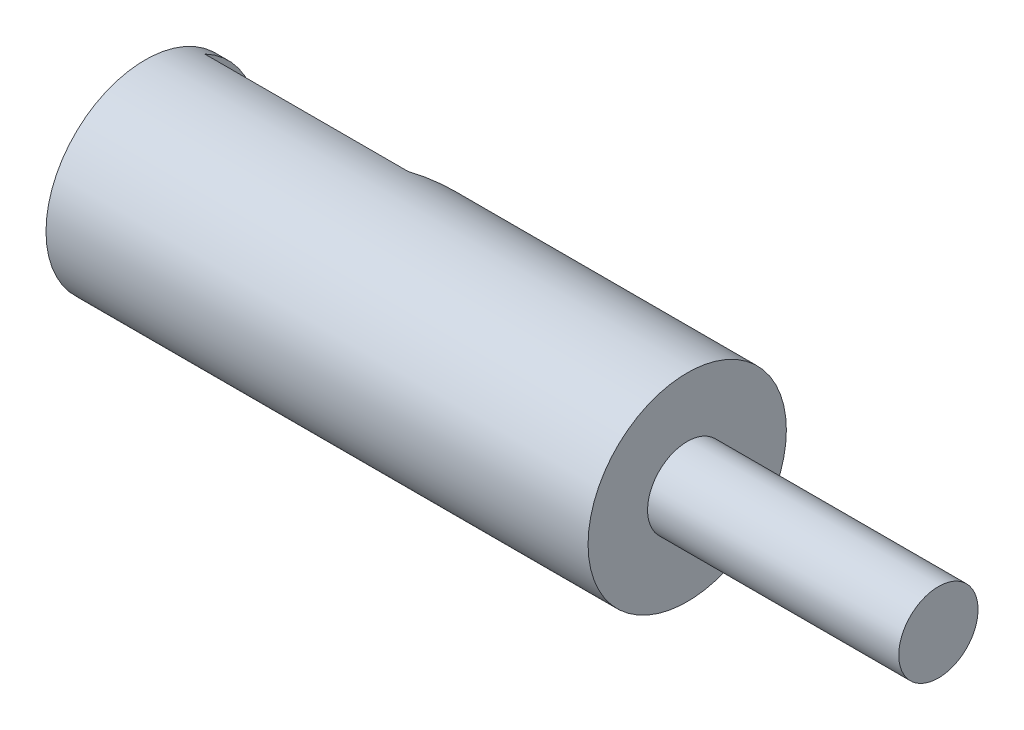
ISO-10303-21;
HEADER;
FILE_DESCRIPTION(('STEP AP214'),'2;1');
FILE_NAME('part.step','',(''),(''),'','','');
FILE_SCHEMA(('AUTOMOTIVE_DESIGN { 1 0 10303 214 1 1 1 1 }'));
ENDSEC;
DATA;
#1=APPLICATION_CONTEXT('core data for automotive mechanical design processes');
#2=APPLICATION_PROTOCOL_DEFINITION('international standard','automotive_design',2000,#1);
#3=PRODUCT_CONTEXT('',#1,'mechanical');
#4=PRODUCT('Part','Part','',(#3));
#5=PRODUCT_RELATED_PRODUCT_CATEGORY('part','',(#4));
#6=PRODUCT_DEFINITION_FORMATION('','',#4);
#7=PRODUCT_DEFINITION_CONTEXT('part definition',#1,'design');
#8=PRODUCT_DEFINITION('design','',#6,#7);
#9=PRODUCT_DEFINITION_SHAPE('','',#8);
#10=(LENGTH_UNIT() NAMED_UNIT(*) SI_UNIT(.MILLI.,.METRE.));
#11=(NAMED_UNIT(*) PLANE_ANGLE_UNIT() SI_UNIT($,.RADIAN.));
#12=(NAMED_UNIT(*) SI_UNIT($,.STERADIAN.) SOLID_ANGLE_UNIT());
#13=UNCERTAINTY_MEASURE_WITH_UNIT(LENGTH_MEASURE(1.E-05),#10,'distance_accuracy_value','');
#14=(GEOMETRIC_REPRESENTATION_CONTEXT(3) GLOBAL_UNCERTAINTY_ASSIGNED_CONTEXT((#13)) GLOBAL_UNIT_ASSIGNED_CONTEXT((#10,
#11,#12)) REPRESENTATION_CONTEXT('',''));
#15=CARTESIAN_POINT('',(0.,0.,0.));
#16=DIRECTION('',(0.,0.,1.));
#17=DIRECTION('',(1.,0.,0.));
#18=AXIS2_PLACEMENT_3D('',#15,#16,#17);
#19=CARTESIAN_POINT('',(-120.,0.,0.));
#20=DIRECTION('',(-1.,0.,0.));
#21=DIRECTION('',(0.,0.,1.));
#22=AXIS2_PLACEMENT_3D('',#19,#20,#21);
#23=CYLINDRICAL_SURFACE('',#22,7.5);
#24=CARTESIAN_POINT('',(-39.,0.,0.));
#25=DIRECTION('',(-1.,0.,0.));
#26=DIRECTION('',(0.,0.,1.));
#27=AXIS2_PLACEMENT_3D('',#24,#25,#26);
#28=CIRCLE('',#27,7.5);
#29=CARTESIAN_POINT('',(-39.,0.,7.5));
#30=VERTEX_POINT('',#29);
#31=EDGE_CURVE('E190',#30,#30,#28,.T.);
#32=ORIENTED_EDGE('',*,*,#31,.T.);
#33=EDGE_LOOP('',(#32));
#34=FACE_BOUND('',#33,.T.);
#35=CARTESIAN_POINT('',(-80.,0.,0.));
#36=DIRECTION('',(-1.,0.,0.));
#37=DIRECTION('',(0.,0.,1.));
#38=AXIS2_PLACEMENT_3D('',#35,#36,#37);
#39=CIRCLE('',#38,7.5);
#40=CARTESIAN_POINT('',(-80.,0.,7.50000000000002));
#41=VERTEX_POINT('',#40);
#42=EDGE_CURVE('E149',#41,#41,#39,.T.);
#43=ORIENTED_EDGE('',*,*,#42,.F.);
#44=EDGE_LOOP('',(#43));
#45=FACE_BOUND('',#44,.T.);
#46=DIRECTION('',(-1.,0.,0.));
#47=VECTOR('',#46,1.);
#48=CARTESIAN_POINT('',(-120.,6.63324958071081,-3.5));
#49=LINE('',#48,#47);
#50=CARTESIAN_POINT('',(-63.62609283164,6.6332495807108,-3.49999999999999));
#51=VERTEX_POINT('',#50);
#52=CARTESIAN_POINT('',(-79.,6.6332495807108,-3.49999999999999));
#53=VERTEX_POINT('',#52);
#54=EDGE_CURVE('E45',#51,#53,#49,.T.);
#55=ORIENTED_EDGE('',*,*,#54,.T.);
#56=CARTESIAN_POINT('',(-79.,0.,0.));
#57=DIRECTION('',(1.,0.,0.));
#58=DIRECTION('',(0.,0.,-1.));
#59=AXIS2_PLACEMENT_3D('',#56,#57,#58);
#60=CIRCLE('',#59,7.5);
#61=CARTESIAN_POINT('',(-79.,-6.63324958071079,-3.5));
#62=VERTEX_POINT('',#61);
#63=EDGE_CURVE('E102',#62,#53,#60,.T.);
#64=ORIENTED_EDGE('',*,*,#63,.F.);
#65=DIRECTION('',(-1.,0.,0.));
#66=VECTOR('',#65,1.);
#67=CARTESIAN_POINT('',(-120.,-6.63324958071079,-3.5));
#68=LINE('',#67,#66);
#69=CARTESIAN_POINT('',(-63.62609283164,-6.6332495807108,-3.5));
#70=VERTEX_POINT('',#69);
#71=EDGE_CURVE('E112',#62,#70,#68,.F.);
#72=ORIENTED_EDGE('',*,*,#71,.T.);
#73=CARTESIAN_POINT('',(-60.,-0.499999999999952,-7.4833147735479));
#74=CARTESIAN_POINT('',(-59.9999590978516,-0.664270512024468,-7.47238155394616));
#75=CARTESIAN_POINT('',(-60.005780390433,-0.828134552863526,-7.45595936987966));
#76=CARTESIAN_POINT('',(-60.0286777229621,-1.15351718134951,-7.4125663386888));
#77=CARTESIAN_POINT('',(-60.0457434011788,-1.31503778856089,-7.38560521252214));
#78=CARTESIAN_POINT('',(-60.0904629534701,-1.6330964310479,-7.32182507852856));
#79=CARTESIAN_POINT('',(-60.1180218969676,-1.78966588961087,-7.28509531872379));
#80=CARTESIAN_POINT('',(-60.1830681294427,-2.09821664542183,-7.20229124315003));
#81=CARTESIAN_POINT('',(-60.22055725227,-2.25019708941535,-7.15621520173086));
#82=CARTESIAN_POINT('',(-60.3045388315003,-2.5480873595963,-7.05562727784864));
#83=CARTESIAN_POINT('',(-60.350997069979,-2.69401777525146,-7.001147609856));
#84=CARTESIAN_POINT('',(-60.4522006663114,-2.97978260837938,-6.88438404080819));
#85=CARTESIAN_POINT('',(-60.5069490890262,-3.11961474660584,-6.82209725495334));
#86=CARTESIAN_POINT('',(-60.6825914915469,-3.52965730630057,-6.62447221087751));
#87=CARTESIAN_POINT('',(-60.8147619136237,-3.78999862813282,-6.47851268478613));
#88=CARTESIAN_POINT('',(-61.1674616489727,-4.39258138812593,-6.09378104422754));
#89=CARTESIAN_POINT('',(-61.4010582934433,-4.71931131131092,-5.84271132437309));
#90=CARTESIAN_POINT('',(-61.7773244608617,-5.16494159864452,-5.44183374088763));
#91=CARTESIAN_POINT('',(-61.9072962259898,-5.30627210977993,-5.3039126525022));
#92=CARTESIAN_POINT('',(-62.1745115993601,-5.57449020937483,-5.02125133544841));
#93=CARTESIAN_POINT('',(-62.3117534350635,-5.70138129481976,-4.87651276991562));
#94=CARTESIAN_POINT('',(-62.6392733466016,-5.98131126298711,-4.53192855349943));
#95=CARTESIAN_POINT('',(-62.8319160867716,-6.12886853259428,-4.32986586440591));
#96=CARTESIAN_POINT('',(-63.1263496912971,-6.33171537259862,-4.0217360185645));
#97=CARTESIAN_POINT('',(-63.2250572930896,-6.39605967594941,-3.91854994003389));
#98=CARTESIAN_POINT('',(-63.424275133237,-6.51895967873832,-3.71049161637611));
#99=CARTESIAN_POINT('',(-63.5247852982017,-6.57751561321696,-3.60561943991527));
#100=CARTESIAN_POINT('',(-63.62609283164,-6.6332495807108,-3.5));
#101=B_SPLINE_CURVE_WITH_KNOTS('',3,(#73,#74,#75,#76,#77,#78,#79,#80,#81,#82,#83,#84,#85,#86,
#87,#88,#89,#90,#91,#92,#93,#94,#95,#96,#97,#98,#99,#100),.UNSPECIFIED.,.F.,.F.,(4,2,2,2,2,2,2,
2,2,2,2,2,2,4),(0.,0.493647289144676,0.986840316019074,1.47567363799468,1.96459729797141,
2.45169127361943,2.9389657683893,3.91486661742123,5.32765638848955,6.03641298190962,
6.74499755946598,7.69096727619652,8.16073400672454,8.63048165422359),.UNSPECIFIED.);
#102=CARTESIAN_POINT('',(-60.,-0.499999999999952,-7.4833147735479));
#103=VERTEX_POINT('',#102);
#104=EDGE_CURVE('E113',#103,#70,#101,.T.);
#105=ORIENTED_EDGE('',*,*,#104,.F.);
#106=CARTESIAN_POINT('',(-60.,0.,0.));
#107=DIRECTION('',(-1.,0.,0.));
#108=DIRECTION('',(0.,0.,1.));
#109=AXIS2_PLACEMENT_3D('',#106,#107,#108);
#110=CIRCLE('',#109,7.5);
#111=CARTESIAN_POINT('',(-60.,0.499999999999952,-7.4833147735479));
#112=VERTEX_POINT('',#111);
#113=EDGE_CURVE('E130',#112,#103,#110,.T.);
#114=ORIENTED_EDGE('',*,*,#113,.F.);
#115=CARTESIAN_POINT('',(-63.62609283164,6.6332495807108,-3.49999999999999));
#116=CARTESIAN_POINT('',(-63.5307378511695,6.58079151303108,-3.59941348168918));
#117=CARTESIAN_POINT('',(-63.4360866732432,6.52583029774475,-3.6981677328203));
#118=CARTESIAN_POINT('',(-63.2483586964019,6.41077979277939,-3.89420471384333));
#119=CARTESIAN_POINT('',(-63.1552821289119,6.35068975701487,-3.99148722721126));
#120=CARTESIAN_POINT('',(-62.8782781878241,6.16227671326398,-4.28130188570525));
#121=CARTESIAN_POINT('',(-62.6970208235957,6.02605311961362,-4.4713381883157));
#122=CARTESIAN_POINT('',(-62.3415143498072,5.72997567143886,-4.84508787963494));
#123=CARTESIAN_POINT('',(-62.1673752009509,5.56985829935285,-5.02869825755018));
#124=CARTESIAN_POINT('',(-61.8311684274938,5.22661404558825,-5.38457139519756));
#125=CARTESIAN_POINT('',(-61.6690872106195,5.04351371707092,-5.55684690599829));
#126=CARTESIAN_POINT('',(-61.3168814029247,4.59915910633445,-5.93331375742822));
#127=CARTESIAN_POINT('',(-61.1314119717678,4.33030032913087,-6.13314078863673));
#128=CARTESIAN_POINT('',(-60.8780855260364,3.89851974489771,-6.40942070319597));
#129=CARTESIAN_POINT('',(-60.7978838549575,3.75006996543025,-6.49749779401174));
#130=CARTESIAN_POINT('',(-60.6468065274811,3.44381415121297,-6.66487400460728));
#131=CARTESIAN_POINT('',(-60.5759254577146,3.28601362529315,-6.74417821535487));
#132=CARTESIAN_POINT('',(-60.4554319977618,2.98799043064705,-6.88071492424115));
#133=CARTESIAN_POINT('',(-60.4042357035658,2.84908871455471,-6.93943879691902));
#134=CARTESIAN_POINT('',(-60.3100465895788,2.56562588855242,-7.04915890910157));
#135=CARTESIAN_POINT('',(-60.2670498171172,2.42106754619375,-7.10015886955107));
#136=CARTESIAN_POINT('',(-60.190029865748,2.1270741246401,-7.193700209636));
#137=CARTESIAN_POINT('',(-60.1559972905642,1.9776443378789,-7.23625043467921));
#138=CARTESIAN_POINT('',(-60.0975481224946,1.67471052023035,-7.31229945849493));
#139=CARTESIAN_POINT('',(-60.0731272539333,1.5212083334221,-7.34580227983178));
#140=CARTESIAN_POINT('',(-60.0360366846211,1.22373821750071,-7.40090707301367));
#141=CARTESIAN_POINT('',(-60.0225743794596,1.08000708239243,-7.42325401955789));
#142=CARTESIAN_POINT('',(-60.0045438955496,0.79095577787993,-7.45960518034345));
#143=CARTESIAN_POINT('',(-59.9999750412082,0.64563573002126,-7.47361002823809));
#144=CARTESIAN_POINT('',(-60.,0.499999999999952,-7.4833147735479));
#145=B_SPLINE_CURVE_WITH_KNOTS('',3,(#115,#116,#117,#118,#119,#120,#121,#122,#123,#124,#125,
#126,#127,#128,#129,#130,#131,#132,#133,#134,#135,#136,#137,#138,#139,#140,#141,#142,#143,#144),
.UNSPECIFIED.,.F.,.F.,(4,2,2,2,2,2,2,2,2,2,2,2,2,2,4),(0.,0.442160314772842,0.884385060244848,
1.77088666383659,2.66800759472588,3.56410142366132,4.70822222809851,5.27870042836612,
5.84884581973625,6.3261663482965,6.80325619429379,7.27984394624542,7.75621945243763,
8.19394831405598,8.6316439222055),.UNSPECIFIED.);
#146=EDGE_CURVE('E11',#51,#112,#145,.T.);
#147=ORIENTED_EDGE('',*,*,#146,.F.);
#148=EDGE_LOOP('',(#55,#64,#72,#105,#114,#147));
#149=FACE_BOUND('',#148,.T.);
#150=ADVANCED_FACE('F32',(#34,#45,#149),#23,.T.);
#151=CARTESIAN_POINT('',(-80.,7.5,0.));
#152=DIRECTION('',(1.,0.,0.));
#153=DIRECTION('',(0.,0.,-1.));
#154=AXIS2_PLACEMENT_3D('',#151,#152,#153);
#155=PLANE('',#154);
#156=CARTESIAN_POINT('',(-80.,0.,0.));
#157=DIRECTION('',(-1.,0.,0.));
#158=DIRECTION('',(0.,0.,1.));
#159=AXIS2_PLACEMENT_3D('',#156,#157,#158);
#160=CIRCLE('',#159,5.);
#161=CARTESIAN_POINT('',(-80.,0.,5.00000000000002));
#162=VERTEX_POINT('',#161);
#163=EDGE_CURVE('E214',#162,#162,#160,.T.);
#164=ORIENTED_EDGE('',*,*,#163,.F.);
#165=EDGE_LOOP('',(#164));
#166=FACE_BOUND('',#165,.T.);
#167=ORIENTED_EDGE('',*,*,#42,.T.);
#168=EDGE_LOOP('',(#167));
#169=FACE_BOUND('',#168,.T.);
#170=ADVANCED_FACE('F34',(#166,#169),#155,.F.);
#171=CARTESIAN_POINT('',(-120.,0.,0.));
#172=DIRECTION('',(-1.,0.,0.));
#173=DIRECTION('',(0.,0.,1.));
#174=AXIS2_PLACEMENT_3D('',#171,#172,#173);
#175=CYLINDRICAL_SURFACE('',#174,5.);
#176=CARTESIAN_POINT('',(-79.,0.,0.));
#177=DIRECTION('',(-1.,0.,0.));
#178=DIRECTION('',(0.,0.,1.));
#179=AXIS2_PLACEMENT_3D('',#176,#177,#178);
#180=CIRCLE('',#179,5.);
#181=CARTESIAN_POINT('',(-79.,0.,5.));
#182=VERTEX_POINT('',#181);
#183=EDGE_CURVE('E212',#182,#182,#180,.T.);
#184=ORIENTED_EDGE('',*,*,#183,.F.);
#185=EDGE_LOOP('',(#184));
#186=FACE_BOUND('',#185,.T.);
#187=ORIENTED_EDGE('',*,*,#163,.T.);
#188=EDGE_LOOP('',(#187));
#189=FACE_BOUND('',#188,.T.);
#190=ADVANCED_FACE('F185',(#186,#189),#175,.F.);
#191=CARTESIAN_POINT('',(-79.,6.00000000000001,0.));
#192=DIRECTION('',(-1.,0.,0.));
#193=DIRECTION('',(0.,0.,1.));
#194=AXIS2_PLACEMENT_3D('',#191,#192,#193);
#195=PLANE('',#194);
#196=ORIENTED_EDGE('',*,*,#183,.T.);
#197=EDGE_LOOP('',(#196));
#198=FACE_BOUND('',#197,.T.);
#199=CARTESIAN_POINT('',(-79.,0.,0.));
#200=DIRECTION('',(-1.,0.,0.));
#201=DIRECTION('',(0.,0.,1.));
#202=AXIS2_PLACEMENT_3D('',#199,#200,#201);
#203=CIRCLE('',#202,6.);
#204=CARTESIAN_POINT('',(-79.,-4.87339717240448,-3.49999999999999));
#205=VERTEX_POINT('',#204);
#206=CARTESIAN_POINT('',(-79.,4.87339717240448,-3.5));
#207=VERTEX_POINT('',#206);
#208=EDGE_CURVE('E210',#205,#207,#203,.T.);
#209=ORIENTED_EDGE('',*,*,#208,.F.);
#210=DIRECTION('',(0.,-1.,0.));
#211=VECTOR('',#210,1.);
#212=CARTESIAN_POINT('',(-79.,7.50000000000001,-3.5));
#213=LINE('',#212,#211);
#214=EDGE_CURVE('E108',#205,#62,#213,.T.);
#215=ORIENTED_EDGE('',*,*,#214,.T.);
#216=ORIENTED_EDGE('',*,*,#63,.T.);
#217=EDGE_CURVE('E106',#53,#207,#213,.T.);
#218=ORIENTED_EDGE('',*,*,#217,.T.);
#219=EDGE_LOOP('',(#209,#215,#216,#218));
#220=FACE_BOUND('',#219,.T.);
#221=ADVANCED_FACE('F105',(#198,#220),#195,.F.);
#222=CARTESIAN_POINT('',(-120.,0.,0.));
#223=DIRECTION('',(-1.,0.,0.));
#224=DIRECTION('',(0.,0.,1.));
#225=AXIS2_PLACEMENT_3D('',#222,#223,#224);
#226=CYLINDRICAL_SURFACE('',#225,6.);
#227=ORIENTED_EDGE('',*,*,#208,.T.);
#228=DIRECTION('',(-1.,0.,0.));
#229=VECTOR('',#228,1.);
#230=CARTESIAN_POINT('',(-120.,4.87339717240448,-3.5));
#231=LINE('',#230,#229);
#232=CARTESIAN_POINT('',(-76.,4.87339717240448,-3.5));
#233=VERTEX_POINT('',#232);
#234=EDGE_CURVE('E120',#207,#233,#231,.F.);
#235=ORIENTED_EDGE('',*,*,#234,.T.);
#236=CARTESIAN_POINT('',(-76.,0.,0.));
#237=DIRECTION('',(-1.,0.,0.));
#238=DIRECTION('',(0.,0.,1.));
#239=AXIS2_PLACEMENT_3D('',#236,#237,#238);
#240=CIRCLE('',#239,6.);
#241=CARTESIAN_POINT('',(-76.,-4.87339717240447,-3.5));
#242=VERTEX_POINT('',#241);
#243=EDGE_CURVE('E207',#242,#233,#240,.T.);
#244=ORIENTED_EDGE('',*,*,#243,.F.);
#245=DIRECTION('',(-1.,0.,0.));
#246=VECTOR('',#245,1.);
#247=CARTESIAN_POINT('',(-120.,-4.87339717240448,-3.49999999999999));
#248=LINE('',#247,#246);
#249=EDGE_CURVE('E231',#242,#205,#248,.T.);
#250=ORIENTED_EDGE('',*,*,#249,.T.);
#251=EDGE_LOOP('',(#227,#235,#244,#250));
#252=FACE_BOUND('',#251,.T.);
#253=ADVANCED_FACE('F234',(#252),#226,.F.);
#254=CARTESIAN_POINT('',(-76.,6.00000000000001,0.));
#255=DIRECTION('',(1.,0.,0.));
#256=DIRECTION('',(0.,0.,-1.));
#257=AXIS2_PLACEMENT_3D('',#254,#255,#256);
#258=PLANE('',#257);
#259=ORIENTED_EDGE('',*,*,#243,.T.);
#260=DIRECTION('',(0.,-1.,0.));
#261=VECTOR('',#260,1.);
#262=CARTESIAN_POINT('',(-76.,6.00000000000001,-3.5));
#263=LINE('',#262,#261);
#264=CARTESIAN_POINT('',(-76.,3.57071421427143,-3.5));
#265=VERTEX_POINT('',#264);
#266=EDGE_CURVE('E238',#233,#265,#263,.T.);
#267=ORIENTED_EDGE('',*,*,#266,.T.);
#268=CARTESIAN_POINT('',(-76.,0.,0.));
#269=DIRECTION('',(-1.,0.,0.));
#270=DIRECTION('',(0.,0.,1.));
#271=AXIS2_PLACEMENT_3D('',#268,#269,#270);
#272=CIRCLE('',#271,5.);
#273=CARTESIAN_POINT('',(-76.,-3.57071421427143,-3.5));
#274=VERTEX_POINT('',#273);
#275=EDGE_CURVE('E204',#274,#265,#272,.T.);
#276=ORIENTED_EDGE('',*,*,#275,.F.);
#277=EDGE_CURVE('E52',#274,#242,#263,.T.);
#278=ORIENTED_EDGE('',*,*,#277,.T.);
#279=EDGE_LOOP('',(#259,#267,#276,#278));
#280=FACE_BOUND('',#279,.T.);
#281=ADVANCED_FACE('F159',(#280),#258,.F.);
#282=CARTESIAN_POINT('',(-120.,0.,0.));
#283=DIRECTION('',(-1.,0.,0.));
#284=DIRECTION('',(0.,0.,1.));
#285=AXIS2_PLACEMENT_3D('',#282,#283,#284);
#286=CYLINDRICAL_SURFACE('',#285,5.);
#287=CARTESIAN_POINT('',(-41.,0.,0.));
#288=DIRECTION('',(-1.,0.,0.));
#289=DIRECTION('',(0.,0.,1.));
#290=AXIS2_PLACEMENT_3D('',#287,#288,#289);
#291=CIRCLE('',#290,5.);
#292=CARTESIAN_POINT('',(-41.,0.,5.));
#293=VERTEX_POINT('',#292);
#294=EDGE_CURVE('E201',#293,#293,#291,.T.);
#295=ORIENTED_EDGE('',*,*,#294,.F.);
#296=EDGE_LOOP('',(#295));
#297=FACE_BOUND('',#296,.T.);
#298=ORIENTED_EDGE('',*,*,#275,.T.);
#299=DIRECTION('',(-1.,0.,0.));
#300=VECTOR('',#299,1.);
#301=CARTESIAN_POINT('',(-120.,3.57071421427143,-3.5));
#302=LINE('',#301,#300);
#303=CARTESIAN_POINT('',(-60.7094742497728,3.57071421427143,-3.5));
#304=VERTEX_POINT('',#303);
#305=EDGE_CURVE('E235',#265,#304,#302,.F.);
#306=ORIENTED_EDGE('',*,*,#305,.T.);
#307=CARTESIAN_POINT('',(-60.0178799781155,0.,5.));
#308=CARTESIAN_POINT('',(-60.0269361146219,-0.126458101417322,4.99999972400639));
#309=CARTESIAN_POINT('',(-60.039435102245,-0.252672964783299,4.99519529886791));
#310=CARTESIAN_POINT('',(-60.0711542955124,-0.503536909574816,4.97617103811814));
#311=CARTESIAN_POINT('',(-60.0903749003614,-0.628185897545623,4.96195064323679));
#312=CARTESIAN_POINT('',(-60.1352220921,-0.87497646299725,4.9244290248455));
#313=CARTESIAN_POINT('',(-60.1608509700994,-0.997117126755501,4.90112455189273));
#314=CARTESIAN_POINT('',(-60.2180724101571,-1.23804465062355,4.84587764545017));
#315=CARTESIAN_POINT('',(-60.2496675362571,-1.35683004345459,4.81393149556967));
#316=CARTESIAN_POINT('',(-60.318050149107,-1.58953442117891,4.74216274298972));
#317=CARTESIAN_POINT('',(-60.3548023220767,-1.70348015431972,4.70239302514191));
#318=CARTESIAN_POINT('',(-60.4330672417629,-1.92681242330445,4.61538438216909));
#319=CARTESIAN_POINT('',(-60.4745818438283,-2.03619715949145,4.56814254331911));
#320=CARTESIAN_POINT('',(-60.6052971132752,-2.35672956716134,4.41607139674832));
#321=CARTESIAN_POINT('',(-60.7007424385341,-2.560497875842,4.30082006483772));
#322=CARTESIAN_POINT('',(-60.9144439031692,-2.96767268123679,4.03224840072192));
#323=CARTESIAN_POINT('',(-61.0340579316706,-3.16847132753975,3.87610706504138));
#324=CARTESIAN_POINT('',(-61.2807677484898,-3.54234581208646,3.53772687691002));
#325=CARTESIAN_POINT('',(-61.4078788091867,-3.71536218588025,3.35543358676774));
#326=CARTESIAN_POINT('',(-61.6112022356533,-3.96944202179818,3.04407343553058));
#327=CARTESIAN_POINT('',(-61.6876147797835,-4.0597665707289,2.92255689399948));
#328=CARTESIAN_POINT('',(-61.8382794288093,-4.22964179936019,2.67080603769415));
#329=CARTESIAN_POINT('',(-61.912530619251,-4.30918796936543,2.54056810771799));
#330=CARTESIAN_POINT('',(-62.0562478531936,-4.45680377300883,2.27164436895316));
#331=CARTESIAN_POINT('',(-62.1257239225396,-4.52489791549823,2.13297748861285));
#332=CARTESIAN_POINT('',(-62.2569766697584,-4.64896821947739,1.84699488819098));
#333=CARTESIAN_POINT('',(-62.3187603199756,-4.70495538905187,1.69968718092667));
#334=CARTESIAN_POINT('',(-62.4391007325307,-4.81088938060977,1.37426928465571));
#335=CARTESIAN_POINT('',(-62.4958918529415,-4.85878454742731,1.19478917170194));
#336=CARTESIAN_POINT('',(-62.5648774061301,-4.91577098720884,0.918711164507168));
#337=CARTESIAN_POINT('',(-62.5851645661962,-4.93228457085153,0.825604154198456));
#338=CARTESIAN_POINT('',(-62.6196127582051,-4.96010075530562,0.63751326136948));
#339=CARTESIAN_POINT('',(-62.6337767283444,-4.9714058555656,0.542530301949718));
#340=CARTESIAN_POINT('',(-62.6554647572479,-4.98864369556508,0.350449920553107));
#341=CARTESIAN_POINT('',(-62.6629282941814,-4.99452747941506,0.253341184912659));
#342=CARTESIAN_POINT('',(-62.6706375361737,-5.00060411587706,0.0586594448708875));
#343=CARTESIAN_POINT('',(-62.670883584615,-5.00079723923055,-0.0389135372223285));
#344=CARTESIAN_POINT('',(-62.6641440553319,-4.99548640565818,-0.233691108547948));
#345=CARTESIAN_POINT('',(-62.6571554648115,-4.98998007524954,-0.330895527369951));
#346=CARTESIAN_POINT('',(-62.6362790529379,-4.97340067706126,-0.524115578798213));
#347=CARTESIAN_POINT('',(-62.6223876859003,-4.96232474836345,-0.620130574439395));
#348=CARTESIAN_POINT('',(-62.5861214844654,-4.93307319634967,-0.822524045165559));
#349=CARTESIAN_POINT('',(-62.5628835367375,-4.91416610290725,-0.928641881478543));
#350=CARTESIAN_POINT('',(-62.5095253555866,-4.86999436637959,-1.13780529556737));
#351=CARTESIAN_POINT('',(-62.4794002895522,-4.844725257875,-1.2408486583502));
#352=CARTESIAN_POINT('',(-62.3804261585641,-4.75994676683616,-1.54507784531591));
#353=CARTESIAN_POINT('',(-62.3030362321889,-4.69151020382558,-1.74107191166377));
#354=CARTESIAN_POINT('',(-62.1571659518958,-4.5551080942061,-2.0672098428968));
#355=CARTESIAN_POINT('',(-62.0918600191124,-4.4919358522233,-2.20091999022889));
#356=CARTESIAN_POINT('',(-61.9565264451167,-4.3551646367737,-2.46049748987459));
#357=CARTESIAN_POINT('',(-61.886496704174,-4.28156101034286,-2.58636130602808));
#358=CARTESIAN_POINT('',(-61.7438861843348,-4.12434357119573,-2.83035063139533));
#359=CARTESIAN_POINT('',(-61.6713025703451,-4.04071836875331,-2.94846709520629));
#360=CARTESIAN_POINT('',(-61.5254852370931,-3.86380892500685,-3.17676337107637));
#361=CARTESIAN_POINT('',(-61.4522516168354,-3.77052613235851,-3.2869443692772));
#362=CARTESIAN_POINT('',(-61.3045518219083,-3.57156857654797,-3.5022870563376));
#363=CARTESIAN_POINT('',(-61.2301128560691,-3.46560979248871,-3.60720539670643));
#364=CARTESIAN_POINT('',(-61.0837513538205,-3.24375012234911,-3.80794730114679));
#365=CARTESIAN_POINT('',(-61.0118291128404,-3.12784807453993,-3.90376979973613));
#366=CARTESIAN_POINT('',(-60.8721202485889,-2.88651697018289,-4.08543624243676));
#367=CARTESIAN_POINT('',(-60.8043265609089,-2.76110506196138,-4.17129747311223));
#368=CARTESIAN_POINT('',(-60.674209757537,-2.50091915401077,-4.3322959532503));
#369=CARTESIAN_POINT('',(-60.6118848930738,-2.36614817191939,-4.4074366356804));
#370=CARTESIAN_POINT('',(-60.5079203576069,-2.12036496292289,-4.52970603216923));
#371=CARTESIAN_POINT('',(-60.4648515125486,-2.01116575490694,-4.57927640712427));
#372=CARTESIAN_POINT('',(-60.3834141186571,-1.78798865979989,-4.67093579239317));
#373=CARTESIAN_POINT('',(-60.3450445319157,-1.67401183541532,-4.71302645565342));
#374=CARTESIAN_POINT('',(-60.2736216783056,-1.44179987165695,-4.78916894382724));
#375=CARTESIAN_POINT('',(-60.2405674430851,-1.32356551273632,-4.82322223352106));
#376=CARTESIAN_POINT('',(-60.1803453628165,-1.083543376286,-4.88274638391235));
#377=CARTESIAN_POINT('',(-60.1531746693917,-0.96175735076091,-4.90822140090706));
#378=CARTESIAN_POINT('',(-60.1050298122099,-0.71463135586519,-4.95026334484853));
#379=CARTESIAN_POINT('',(-60.0840953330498,-0.589273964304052,-4.96677374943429));
#380=CARTESIAN_POINT('',(-60.0490180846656,-0.3367209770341,-4.99026061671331));
#381=CARTESIAN_POINT('',(-60.0348753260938,-0.209525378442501,-4.99723706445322));
#382=CARTESIAN_POINT('',(-60.0135931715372,0.0455800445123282,-5.00141894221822));
#383=CARTESIAN_POINT('',(-60.0064519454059,0.173489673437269,-4.99862692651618));
#384=CARTESIAN_POINT('',(-59.9991951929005,0.428907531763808,-4.9832124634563));
#385=CARTESIAN_POINT('',(-59.9990791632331,0.556415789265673,-4.97059072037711));
#386=CARTESIAN_POINT('',(-60.0053974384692,0.797803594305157,-4.93729700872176));
#387=CARTESIAN_POINT('',(-60.0112076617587,0.91182246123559,-4.91750828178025));
#388=CARTESIAN_POINT('',(-60.0281979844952,1.13784668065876,-4.87018074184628));
#389=CARTESIAN_POINT('',(-60.0393798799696,1.24985134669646,-4.84263933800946));
#390=CARTESIAN_POINT('',(-60.0804994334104,1.58167737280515,-4.7487899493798));
#391=CARTESIAN_POINT('',(-60.118017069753,1.79750828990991,-4.6712290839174));
#392=CARTESIAN_POINT('',(-60.2112941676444,2.22115710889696,-4.4857577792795));
#393=CARTESIAN_POINT('',(-60.2676773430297,2.42838285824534,-4.37683038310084));
#394=CARTESIAN_POINT('',(-60.3933975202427,2.82286122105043,-4.13342435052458));
#395=CARTESIAN_POINT('',(-60.4627381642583,3.01010819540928,-3.99893852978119));
#396=CARTESIAN_POINT('',(-60.6204079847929,3.38949665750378,-3.68521975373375));
#397=CARTESIAN_POINT('',(-60.7100207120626,3.57803968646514,-3.50229120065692));
#398=CARTESIAN_POINT('',(-60.8915787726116,3.9242418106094,-3.10949921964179));
#399=CARTESIAN_POINT('',(-60.9835281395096,4.0818427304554,-2.89958626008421));
#400=CARTESIAN_POINT('',(-61.1218545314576,4.30214146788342,-2.5521877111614));
#401=CARTESIAN_POINT('',(-61.1706823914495,4.37633193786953,-2.42283376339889));
#402=CARTESIAN_POINT('',(-61.2641977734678,4.51340843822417,-2.15674220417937));
#403=CARTESIAN_POINT('',(-61.3088844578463,4.576292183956,-2.02000310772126));
#404=CARTESIAN_POINT('',(-61.3919624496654,4.68985198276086,-1.74012620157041));
#405=CARTESIAN_POINT('',(-61.4303695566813,4.74055882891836,-1.59700564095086));
#406=CARTESIAN_POINT('',(-61.4989187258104,4.82911689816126,-1.30494310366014));
#407=CARTESIAN_POINT('',(-61.529065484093,4.86697542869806,-1.15600448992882));
#408=CARTESIAN_POINT('',(-61.5717604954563,4.91984140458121,-0.89832859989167));
#409=CARTESIAN_POINT('',(-61.586876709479,4.93829547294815,-0.790711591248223));
#410=CARTESIAN_POINT('',(-61.6115021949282,4.96816183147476,-0.573877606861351));
#411=CARTESIAN_POINT('',(-61.6210127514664,4.97957573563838,-0.464661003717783));
#412=CARTESIAN_POINT('',(-61.6340457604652,4.99517954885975,-0.24544956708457));
#413=CARTESIAN_POINT('',(-61.6375733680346,4.99937567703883,-0.135455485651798));
#414=CARTESIAN_POINT('',(-61.638512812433,5.00049501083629,0.0846005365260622));
#415=CARTESIAN_POINT('',(-61.6359243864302,4.99741790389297,0.194662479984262));
#416=CARTESIAN_POINT('',(-61.6247428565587,4.98404811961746,0.413889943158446));
#417=CARTESIAN_POINT('',(-61.6161578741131,4.9737652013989,0.523056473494));
#418=CARTESIAN_POINT('',(-61.5933397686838,4.94615962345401,0.739912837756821));
#419=CARTESIAN_POINT('',(-61.5791046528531,4.92883447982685,0.847602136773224));
#420=CARTESIAN_POINT('',(-61.5286499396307,4.86660564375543,1.16761554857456));
#421=CARTESIAN_POINT('',(-61.4846856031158,4.81145359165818,1.37680624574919));
#422=CARTESIAN_POINT('',(-61.3658763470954,4.65557927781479,1.84493801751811));
#423=CARTESIAN_POINT('',(-61.2857004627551,4.54608223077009,2.09955111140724));
#424=CARTESIAN_POINT('',(-61.1122446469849,4.28924305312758,2.58414696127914));
#425=CARTESIAN_POINT('',(-61.0189444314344,4.1418420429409,2.81409060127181));
#426=CARTESIAN_POINT('',(-60.8289451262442,3.80986420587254,3.24976810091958));
#427=CARTESIAN_POINT('',(-60.7322162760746,3.62477481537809,3.45509833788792));
#428=CARTESIAN_POINT('',(-60.5468058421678,3.22131120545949,3.83401040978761));
#429=CARTESIAN_POINT('',(-60.4581161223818,3.00297125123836,4.00762452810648));
#430=CARTESIAN_POINT('',(-60.3075370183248,2.56353245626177,4.29991366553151));
#431=CARTESIAN_POINT('',(-60.2437150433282,2.34584698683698,4.42266618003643));
#432=CARTESIAN_POINT('',(-60.1626105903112,2.00460782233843,4.5822885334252));
#433=CARTESIAN_POINT('',(-60.1380110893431,1.88838981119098,4.63141748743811));
#434=CARTESIAN_POINT('',(-60.0943433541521,1.6516763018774,4.72101171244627));
#435=CARTESIAN_POINT('',(-60.0752725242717,1.53118284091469,4.76148104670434));
#436=CARTESIAN_POINT('',(-60.0443897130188,1.29537089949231,4.83073842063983));
#437=CARTESIAN_POINT('',(-60.0321593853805,1.18029005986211,4.86015065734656));
#438=CARTESIAN_POINT('',(-60.0133742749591,0.947924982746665,4.91076028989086));
#439=CARTESIAN_POINT('',(-60.0068169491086,0.830641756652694,4.93196136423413));
#440=CARTESIAN_POINT('',(-59.9996443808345,0.594652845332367,4.96594423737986));
#441=CARTESIAN_POINT('',(-59.9990304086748,0.475946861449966,4.97872423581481));
#442=CARTESIAN_POINT('',(-60.0038904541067,0.23808875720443,4.99575084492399));
#443=CARTESIAN_POINT('',(-60.0093624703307,0.118936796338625,5.00000025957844));
#444=CARTESIAN_POINT('',(-60.0178799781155,0.,5.));
#445=B_SPLINE_CURVE_WITH_KNOTS('',3,(#307,#308,#309,#310,#311,#312,#313,#314,#315,#316,#317,
#318,#319,#320,#321,#322,#323,#324,#325,#326,#327,#328,#329,#330,#331,#332,#333,#334,#335,#336,
#337,#338,#339,#340,#341,#342,#343,#344,#345,#346,#347,#348,#349,#350,#351,#352,#353,#354,#355,
#356,#357,#358,#359,#360,#361,#362,#363,#364,#365,#366,#367,#368,#369,#370,#371,#372,#373,#374,
#375,#376,#377,#378,#379,#380,#381,#382,#383,#384,#385,#386,#387,#388,#389,#390,#391,#392,#393,
#394,#395,#396,#397,#398,#399,#400,#401,#402,#403,#404,#405,#406,#407,#408,#409,#410,#411,#412,
#413,#414,#415,#416,#417,#418,#419,#420,#421,#422,#423,#424,#425,#426,#427,#428,#429,#430,#431,
#432,#433,#434,#435,#436,#437,#438,#439,#440,#441,#442,#443,#444),.UNSPECIFIED.,.T.,.F.,(4,2,2,
2,2,2,2,2,2,2,2,2,2,2,2,2,2,2,2,2,2,2,2,2,2,2,2,2,2,2,2,2,2,2,2,2,2,2,2,2,2,2,2,2,2,2,2,2,2,2,2,
2,2,2,2,2,2,2,2,2,2,2,2,2,2,2,2,2,4),(0.,0.380217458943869,0.76045750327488,1.14083368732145,
1.52137371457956,1.89942471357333,2.27762349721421,3.03323591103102,3.87366161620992,
4.71586283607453,5.22416944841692,5.73268808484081,6.24010417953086,6.74705695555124,
7.32748771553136,7.61733120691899,7.90703546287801,8.19933089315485,8.49161241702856,
8.78401570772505,9.07656934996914,9.40685717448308,9.73737747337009,10.3993063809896,
10.8837625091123,11.3684354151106,11.8536644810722,12.3388208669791,12.838263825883,
13.3377652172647,13.8363863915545,14.3348475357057,14.7167569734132,15.0985819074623,
15.4803372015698,15.8619072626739,16.245856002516,16.6298053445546,17.0136542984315,
17.3974757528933,17.7446667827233,18.0919739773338,18.7859969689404,19.5057045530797,
20.2256147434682,21.0551761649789,21.8862826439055,22.3564864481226,22.8267851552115,
23.2958817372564,23.7647110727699,24.0950562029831,24.4253255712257,24.7553102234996,
25.0853090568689,25.4148618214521,25.7445309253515,26.404103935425,27.265201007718,
28.1276438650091,29.00271031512,29.8768810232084,30.6471348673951,31.0323852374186,
31.4174544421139,31.7752594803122,32.13290404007,32.4906250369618,32.8482284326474),.UNSPECIFIED.);
#446=CARTESIAN_POINT('',(-60.,0.499999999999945,-4.97493718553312));
#447=VERTEX_POINT('',#446);
#448=EDGE_CURVE('E164',#447,#304,#445,.T.);
#449=ORIENTED_EDGE('',*,*,#448,.F.);
#450=CARTESIAN_POINT('',(-60.,0.,0.));
#451=DIRECTION('',(-1.,0.,0.));
#452=DIRECTION('',(0.,0.,1.));
#453=AXIS2_PLACEMENT_3D('',#450,#451,#452);
#454=CIRCLE('',#453,5.);
#455=CARTESIAN_POINT('',(-60.,-0.499999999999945,-4.97493718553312));
#456=VERTEX_POINT('',#455);
#457=EDGE_CURVE('E150',#456,#447,#454,.F.);
#458=ORIENTED_EDGE('',*,*,#457,.F.);
#459=CARTESIAN_POINT('',(-60.0178799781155,0.,5.));
#460=CARTESIAN_POINT('',(-60.0092150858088,-0.12100489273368,4.99999952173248));
#461=CARTESIAN_POINT('',(-60.0037009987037,-0.242243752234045,4.99560093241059));
#462=CARTESIAN_POINT('',(-59.9989709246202,-0.484248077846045,4.97797463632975));
#463=CARTESIAN_POINT('',(-59.9997576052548,-0.605013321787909,4.96474319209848));
#464=CARTESIAN_POINT('',(-60.0074837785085,-0.845215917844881,4.92953976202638));
#465=CARTESIAN_POINT('',(-60.014430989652,-0.964651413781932,4.90755683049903));
#466=CARTESIAN_POINT('',(-60.0341956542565,-1.20118797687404,4.85508316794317));
#467=CARTESIAN_POINT('',(-60.0470155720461,-1.31828804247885,4.82458886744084));
#468=CARTESIAN_POINT('',(-60.0780329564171,-1.54872080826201,4.75561262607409));
#469=CARTESIAN_POINT('',(-60.0962028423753,-1.66206959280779,4.7171719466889));
#470=CARTESIAN_POINT('',(-60.1374394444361,-1.88496698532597,4.632615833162));
#471=CARTESIAN_POINT('',(-60.1605080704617,-1.99451409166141,4.58649740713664));
#472=CARTESIAN_POINT('',(-60.2362016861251,-2.3164538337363,4.4373283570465));
#473=CARTESIAN_POINT('',(-60.2953493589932,-2.52239012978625,4.32338953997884));
#474=CARTESIAN_POINT('',(-60.4305353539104,-2.92711368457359,4.06131016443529));
#475=CARTESIAN_POINT('',(-60.5074645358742,-3.12439835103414,3.91133730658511));
#476=CARTESIAN_POINT('',(-60.669034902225,-3.49323757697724,3.58578846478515));
#477=CARTESIAN_POINT('',(-60.7536848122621,-3.66476242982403,3.41018337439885));
#478=CARTESIAN_POINT('',(-60.9380346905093,-4.00660244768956,3.00478716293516));
#479=CARTESIAN_POINT('',(-61.0378885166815,-4.1719376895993,2.77084398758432));
#480=CARTESIAN_POINT('',(-61.226431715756,-4.46179143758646,2.27481964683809));
#481=CARTESIAN_POINT('',(-61.3151302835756,-4.58634369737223,2.01276198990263));
#482=CARTESIAN_POINT('',(-61.449595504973,-4.76646331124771,1.52695069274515));
#483=CARTESIAN_POINT('',(-61.5005410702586,-4.83129117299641,1.30813132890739));
#484=CARTESIAN_POINT('',(-61.5604362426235,-4.90592017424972,0.97217994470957));
#485=CARTESIAN_POINT('',(-61.5776447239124,-4.92702473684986,0.858944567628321));
#486=CARTESIAN_POINT('',(-61.6059095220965,-4.96142289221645,0.630553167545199));
#487=CARTESIAN_POINT('',(-61.6169683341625,-4.97471965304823,0.515397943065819));
#488=CARTESIAN_POINT('',(-61.6324907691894,-4.9933275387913,0.283373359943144));
#489=CARTESIAN_POINT('',(-61.6369186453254,-4.99859538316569,0.166498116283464));
#490=CARTESIAN_POINT('',(-61.6388639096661,-5.00091350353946,-0.0673919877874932));
#491=CARTESIAN_POINT('',(-61.6363812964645,-4.99796377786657,-0.184406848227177));
#492=CARTESIAN_POINT('',(-61.6246156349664,-4.9838964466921,-0.417645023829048));
#493=CARTESIAN_POINT('',(-61.6153299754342,-4.9727757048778,-0.533868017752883));
#494=CARTESIAN_POINT('',(-61.5903802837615,-4.94256551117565,-0.764595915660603));
#495=CARTESIAN_POINT('',(-61.5747136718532,-4.92347283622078,-0.879100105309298));
#496=CARTESIAN_POINT('',(-61.5215029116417,-4.85765525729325,-1.20405553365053));
#497=CARTESIAN_POINT('',(-61.4767751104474,-4.80133299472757,-1.41147133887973));
#498=CARTESIAN_POINT('',(-61.3726888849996,-4.66421759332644,-1.81395145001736));
#499=CARTESIAN_POINT('',(-61.3133251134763,-4.58341550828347,-2.00901120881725));
#500=CARTESIAN_POINT('',(-61.1740989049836,-4.38282562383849,-2.41907526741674));
#501=CARTESIAN_POINT('',(-61.0924706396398,-4.25863246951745,-2.63131938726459));
#502=CARTESIAN_POINT('',(-60.9249529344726,-3.9813856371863,-3.03455227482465));
#503=CARTESIAN_POINT('',(-60.8390584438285,-3.8282971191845,-3.22551493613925));
#504=CARTESIAN_POINT('',(-60.7043153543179,-3.56216674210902,-3.51174711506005));
#505=CARTESIAN_POINT('',(-60.6544413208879,-3.45772982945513,-3.61465001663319));
#506=CARTESIAN_POINT('',(-60.5572513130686,-3.23956731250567,-3.81139947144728));
#507=CARTESIAN_POINT('',(-60.5099344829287,-3.12584484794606,-3.90524906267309));
#508=CARTESIAN_POINT('',(-60.4192870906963,-2.8896064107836,-4.08313914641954));
#509=CARTESIAN_POINT('',(-60.3759539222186,-2.76709628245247,-4.16718606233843));
#510=CARTESIAN_POINT('',(-60.294607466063,-2.5137992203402,-4.32470081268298));
#511=CARTESIAN_POINT('',(-60.2565925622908,-2.38301481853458,-4.39817186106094));
#512=CARTESIAN_POINT('',(-60.1945402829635,-2.14247241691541,-4.51928181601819));
#513=CARTESIAN_POINT('',(-60.1692478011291,-2.03412814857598,-4.56909607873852));
#514=CARTESIAN_POINT('',(-60.1233775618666,-1.81330588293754,-4.6611396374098));
#515=CARTESIAN_POINT('',(-60.102798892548,-1.70082869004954,-4.70337040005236));
#516=CARTESIAN_POINT('',(-60.066906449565,-1.47240615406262,-4.77980315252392));
#517=CARTESIAN_POINT('',(-60.051590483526,-1.35646227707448,-4.81400848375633));
#518=CARTESIAN_POINT('',(-60.026680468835,-1.12186797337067,-4.87401913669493));
#519=CARTESIAN_POINT('',(-60.0170837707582,-1.00321882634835,-4.89982834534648));
#520=CARTESIAN_POINT('',(-60.0039281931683,-0.763523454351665,-4.94286549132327));
#521=CARTESIAN_POINT('',(-60.0003947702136,-0.642469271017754,-4.9600570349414));
#522=CARTESIAN_POINT('',(-59.9996679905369,-0.399450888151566,-4.98551496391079));
#523=CARTESIAN_POINT('',(-60.0024722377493,-0.277487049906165,-4.99378472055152));
#524=CARTESIAN_POINT('',(-60.0144895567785,-0.033569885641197,-5.00137628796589));
#525=CARTESIAN_POINT('',(-60.0237040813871,0.0883834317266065,-5.00069606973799));
#526=CARTESIAN_POINT('',(-60.0484606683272,0.331266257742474,-4.99049475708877));
#527=CARTESIAN_POINT('',(-60.0640025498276,0.452195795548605,-4.98097391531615));
#528=CARTESIAN_POINT('',(-60.1001031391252,0.685110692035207,-4.95414479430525));
#529=CARTESIAN_POINT('',(-60.1203162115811,0.79720622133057,-4.93732331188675));
#530=CARTESIAN_POINT('',(-60.1658606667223,1.01900673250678,-4.89636218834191));
#531=CARTESIAN_POINT('',(-60.1911937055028,1.12871092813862,-4.8722201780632));
#532=CARTESIAN_POINT('',(-60.2743368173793,1.45325287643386,-4.78934419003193));
#533=CARTESIAN_POINT('',(-60.3393177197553,1.66368868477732,-4.72014006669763));
#534=CARTESIAN_POINT('',(-60.4907959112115,2.08546072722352,-4.55047023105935));
#535=CARTESIAN_POINT('',(-60.5786198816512,2.29545808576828,-4.44790773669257));
#536=CARTESIAN_POINT('',(-60.7676340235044,2.69475976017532,-4.21798667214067));
#537=CARTESIAN_POINT('',(-60.8688311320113,2.88405324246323,-4.09061521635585));
#538=CARTESIAN_POINT('',(-61.0998873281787,3.27484243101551,-3.78782796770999));
#539=CARTESIAN_POINT('',(-61.2315338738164,3.47179205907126,-3.60788207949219));
#540=CARTESIAN_POINT('',(-61.4315431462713,3.7432317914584,-3.31750000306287));
#541=CARTESIAN_POINT('',(-61.4987052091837,3.82978944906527,-3.21718383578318));
#542=CARTESIAN_POINT('',(-61.6326711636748,3.99477968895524,-3.00986344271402));
#543=CARTESIAN_POINT('',(-61.6994751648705,4.07321491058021,-2.90286140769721));
#544=CARTESIAN_POINT('',(-61.8268739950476,4.21670881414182,-2.68974499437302));
#545=CARTESIAN_POINT('',(-61.8875819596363,4.28231459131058,-2.58406591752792));
#546=CARTESIAN_POINT('',(-62.0062189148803,4.40606707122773,-2.36689601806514));
#547=CARTESIAN_POINT('',(-62.0641475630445,4.46421285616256,-2.2554044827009));
#548=CARTESIAN_POINT('',(-62.1755637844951,4.57255781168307,-2.0267417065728));
#549=CARTESIAN_POINT('',(-62.2290590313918,4.62277085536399,-1.90958086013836));
#550=CARTESIAN_POINT('',(-62.3298359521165,4.71480797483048,-1.66947230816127));
#551=CARTESIAN_POINT('',(-62.3771188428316,4.75663369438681,-1.54652574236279));
#552=CARTESIAN_POINT('',(-62.4799107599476,4.84556367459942,-1.24637589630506));
#553=CARTESIAN_POINT('',(-62.5315814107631,4.8885034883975,-1.06650313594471));
#554=CARTESIAN_POINT('',(-62.5921756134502,4.93799201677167,-0.790559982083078));
#555=CARTESIAN_POINT('',(-62.6095507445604,4.95199816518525,-0.697602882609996));
#556=CARTESIAN_POINT('',(-62.6380230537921,4.97480537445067,-0.51011045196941));
#557=CARTESIAN_POINT('',(-62.6491228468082,4.98360860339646,-0.415575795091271));
#558=CARTESIAN_POINT('',(-62.6646055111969,4.9958579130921,-0.224930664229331));
#559=CARTESIAN_POINT('',(-62.6689401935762,4.99926556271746,-0.12881376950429));
#560=CARTESIAN_POINT('',(-62.6705349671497,5.00052123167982,0.0635139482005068));
#561=CARTESIAN_POINT('',(-62.6677952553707,4.99836940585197,0.159724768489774));
#562=CARTESIAN_POINT('',(-62.6553693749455,4.98855591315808,0.351472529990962));
#563=CARTESIAN_POINT('',(-62.6456785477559,4.98089055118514,0.4470089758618));
#564=CARTESIAN_POINT('',(-62.6197875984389,4.96022083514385,0.636644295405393));
#565=CARTESIAN_POINT('',(-62.6035840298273,4.94721365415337,0.730742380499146));
#566=CARTESIAN_POINT('',(-62.5618142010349,4.91325738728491,0.93401320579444));
#567=CARTESIAN_POINT('',(-62.535073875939,4.89128743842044,1.04277437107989));
#568=CARTESIAN_POINT('',(-62.4747034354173,4.84071591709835,1.25681487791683));
#569=CARTESIAN_POINT('',(-62.4410681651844,4.81210938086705,1.36209154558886));
#570=CARTESIAN_POINT('',(-62.3317320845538,4.71694835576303,1.67251178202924));
#571=CARTESIAN_POINT('',(-62.2476706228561,4.64110568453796,1.8719401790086));
#572=CARTESIAN_POINT('',(-62.0915775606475,4.49156456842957,2.20207580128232));
#573=CARTESIAN_POINT('',(-62.0225470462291,4.42295666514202,2.33665668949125));
#574=CARTESIAN_POINT('',(-61.8803819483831,4.27493780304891,2.59757393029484));
#575=CARTESIAN_POINT('',(-61.8072456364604,4.19552227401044,2.72390676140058));
#576=CARTESIAN_POINT('',(-61.6590633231,4.02626459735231,2.96838809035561));
#577=CARTESIAN_POINT('',(-61.584015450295,3.93641189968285,3.08652811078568));
#578=CARTESIAN_POINT('',(-61.4339359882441,3.74659503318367,3.31436280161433));
#579=CARTESIAN_POINT('',(-61.3589043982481,3.64663238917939,3.42405874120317));
#580=CARTESIAN_POINT('',(-61.2088337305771,3.43441931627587,3.63701182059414));
#581=CARTESIAN_POINT('',(-61.1338310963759,3.32194623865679,3.74007321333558));
#582=CARTESIAN_POINT('',(-60.9871319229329,3.08672978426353,3.93644107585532));
#583=CARTESIAN_POINT('',(-60.9154358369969,2.96398500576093,4.02974621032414));
#584=CARTESIAN_POINT('',(-60.7770422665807,2.70871346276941,4.20557358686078));
#585=CARTESIAN_POINT('',(-60.710336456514,2.57620375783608,4.28811396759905));
#586=CARTESIAN_POINT('',(-60.5833540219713,2.30169538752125,4.44149655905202));
#587=CARTESIAN_POINT('',(-60.5230746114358,2.15970087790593,4.51234384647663));
#588=CARTESIAN_POINT('',(-60.4257264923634,1.90665912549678,4.62366123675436));
#589=CARTESIAN_POINT('',(-60.3867941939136,1.79765110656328,4.66716085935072));
#590=CARTESIAN_POINT('',(-60.3137243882,1.57542492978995,4.74678401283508));
#591=CARTESIAN_POINT('',(-60.279585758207,1.4622077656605,4.78290927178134));
#592=CARTESIAN_POINT('',(-60.2167019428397,1.23234961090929,4.84721848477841));
#593=CARTESIAN_POINT('',(-60.1879454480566,1.11571640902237,4.87541915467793));
#594=CARTESIAN_POINT('',(-60.1362181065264,0.87952941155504,4.92350905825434));
#595=CARTESIAN_POINT('',(-60.1132447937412,0.75997688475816,4.94340183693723));
#596=CARTESIAN_POINT('',(-60.0759709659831,0.534032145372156,4.97253368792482));
#597=CARTESIAN_POINT('',(-60.0609403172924,0.427892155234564,4.98280340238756));
#598=CARTESIAN_POINT('',(-60.0357384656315,0.21456306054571,4.99653782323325));
#599=CARTESIAN_POINT('',(-60.0255687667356,0.107373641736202,5.0000004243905));
#600=CARTESIAN_POINT('',(-60.0178799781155,0.,5.));
#601=B_SPLINE_CURVE_WITH_KNOTS('',3,(#459,#460,#461,#462,#463,#464,#465,#466,#467,#468,#469,
#470,#471,#472,#473,#474,#475,#476,#477,#478,#479,#480,#481,#482,#483,#484,#485,#486,#487,#488,
#489,#490,#491,#492,#493,#494,#495,#496,#497,#498,#499,#500,#501,#502,#503,#504,#505,#506,#507,
#508,#509,#510,#511,#512,#513,#514,#515,#516,#517,#518,#519,#520,#521,#522,#523,#524,#525,#526,
#527,#528,#529,#530,#531,#532,#533,#534,#535,#536,#537,#538,#539,#540,#541,#542,#543,#544,#545,
#546,#547,#548,#549,#550,#551,#552,#553,#554,#555,#556,#557,#558,#559,#560,#561,#562,#563,#564,
#565,#566,#567,#568,#569,#570,#571,#572,#573,#574,#575,#576,#577,#578,#579,#580,#581,#582,#583,
#584,#585,#586,#587,#588,#589,#590,#591,#592,#593,#594,#595,#596,#597,#598,#599,#600),
.UNSPECIFIED.,.T.,.F.,(4,2,2,2,2,2,2,2,2,2,2,2,2,2,2,2,2,2,2,2,2,2,2,2,2,2,2,2,2,2,2,2,2,2,2,2,
2,2,2,2,2,2,2,2,2,2,2,2,2,2,2,2,2,2,2,2,2,2,2,2,2,2,2,2,2,2,2,2,2,2,4),(0.,0.363836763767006,
0.72782757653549,1.09227507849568,1.4568756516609,1.81962856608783,2.18252317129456,
2.90754529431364,3.68317920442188,4.45970083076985,5.365825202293,6.27119772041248,
6.96964678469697,7.31865990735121,7.66753131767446,8.01827677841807,8.36902231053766,
8.71990254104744,9.07092477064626,9.72679556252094,10.3829063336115,11.1575110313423,
11.9330557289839,12.3971680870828,12.8611241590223,13.3247744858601,13.7882836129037,
14.1536183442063,14.518882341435,14.8839939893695,15.248936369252,15.6154072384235,
15.9817395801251,16.3481549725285,16.714559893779,17.0595857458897,17.4047233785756,
18.0944884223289,18.840767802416,19.58743583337,20.4763577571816,20.9217185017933,
21.3669340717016,21.7818461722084,22.196809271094,22.6110384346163,23.0251863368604,
23.5987360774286,23.8852348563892,24.1716141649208,24.4600242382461,24.7484262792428,
25.0370217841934,25.3257702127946,25.6676413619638,26.009769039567,26.6949659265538,
27.1926955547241,27.6906363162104,28.1890848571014,28.6874583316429,29.1968402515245,
29.7062917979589,30.214873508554,30.7232338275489,31.0938537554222,31.4643867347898,
31.8341321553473,32.2037196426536,32.5264702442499,32.8493206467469),.UNSPECIFIED.);
#602=CARTESIAN_POINT('',(-60.7094742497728,-3.57071421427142,-3.50000000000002));
#603=VERTEX_POINT('',#602);
#604=EDGE_CURVE('E143',#603,#456,#601,.T.);
#605=ORIENTED_EDGE('',*,*,#604,.F.);
#606=DIRECTION('',(-1.,0.,0.));
#607=VECTOR('',#606,1.);
#608=CARTESIAN_POINT('',(-120.,-3.57071421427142,-3.5));
#609=LINE('',#608,#607);
#610=EDGE_CURVE('E228',#603,#274,#609,.T.);
#611=ORIENTED_EDGE('',*,*,#610,.T.);
#612=EDGE_LOOP('',(#298,#306,#449,#458,#605,#611));
#613=FACE_BOUND('',#612,.T.);
#614=ADVANCED_FACE('F153',(#297,#613),#286,.F.);
#615=CARTESIAN_POINT('',(-41.,5.,0.));
#616=DIRECTION('',(1.,0.,0.));
#617=DIRECTION('',(0.,0.,-1.));
#618=AXIS2_PLACEMENT_3D('',#615,#616,#617);
#619=PLANE('',#618);
#620=ORIENTED_EDGE('',*,*,#294,.T.);
#621=EDGE_LOOP('',(#620));
#622=FACE_BOUND('',#621,.T.);
#623=ADVANCED_FACE('F158',(#622),#619,.F.);
#624=CARTESIAN_POINT('',(-20.,3.00000000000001,0.));
#625=DIRECTION('',(-1.,0.,0.));
#626=DIRECTION('',(0.,0.,1.));
#627=AXIS2_PLACEMENT_3D('',#624,#625,#626);
#628=PLANE('',#627);
#629=CARTESIAN_POINT('',(-20.,0.,0.));
#630=DIRECTION('',(-1.,0.,0.));
#631=DIRECTION('',(0.,0.,1.));
#632=AXIS2_PLACEMENT_3D('',#629,#630,#631);
#633=CIRCLE('',#632,3.);
#634=CARTESIAN_POINT('',(-20.,0.,3.));
#635=VERTEX_POINT('',#634);
#636=EDGE_CURVE('E196',#635,#635,#633,.T.);
#637=ORIENTED_EDGE('',*,*,#636,.F.);
#638=EDGE_LOOP('',(#637));
#639=FACE_BOUND('',#638,.T.);
#640=ADVANCED_FACE('F296',(#639),#628,.F.);
#641=CARTESIAN_POINT('',(-120.,0.,0.));
#642=DIRECTION('',(-1.,0.,0.));
#643=DIRECTION('',(0.,0.,1.));
#644=AXIS2_PLACEMENT_3D('',#641,#642,#643);
#645=CYLINDRICAL_SURFACE('',#644,3.);
#646=CARTESIAN_POINT('',(-39.,0.,0.));
#647=DIRECTION('',(-1.,0.,0.));
#648=DIRECTION('',(0.,0.,1.));
#649=AXIS2_PLACEMENT_3D('',#646,#647,#648);
#650=CIRCLE('',#649,3.);
#651=CARTESIAN_POINT('',(-39.,0.,3.));
#652=VERTEX_POINT('',#651);
#653=EDGE_CURVE('E194',#652,#652,#650,.T.);
#654=ORIENTED_EDGE('',*,*,#653,.F.);
#655=EDGE_LOOP('',(#654));
#656=FACE_BOUND('',#655,.T.);
#657=ORIENTED_EDGE('',*,*,#636,.T.);
#658=EDGE_LOOP('',(#657));
#659=FACE_BOUND('',#658,.T.);
#660=ADVANCED_FACE('F305',(#656,#659),#645,.T.);
#661=CARTESIAN_POINT('',(-39.,7.50000000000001,0.));
#662=DIRECTION('',(-1.,0.,0.));
#663=DIRECTION('',(0.,0.,1.));
#664=AXIS2_PLACEMENT_3D('',#661,#662,#663);
#665=PLANE('',#664);
#666=ORIENTED_EDGE('',*,*,#31,.F.);
#667=EDGE_LOOP('',(#666));
#668=FACE_BOUND('',#667,.T.);
#669=ORIENTED_EDGE('',*,*,#653,.T.);
#670=EDGE_LOOP('',(#669));
#671=FACE_BOUND('',#670,.T.);
#672=ADVANCED_FACE('F139',(#668,#671),#665,.F.);
#673=CARTESIAN_POINT('',(-67.,-0.499999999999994,-3.5));
#674=DIRECTION('',(0.,0.,-1.));
#675=DIRECTION('',(-1.,0.,0.));
#676=AXIS2_PLACEMENT_3D('',#673,#674,#675);
#677=CYLINDRICAL_SURFACE('',#676,7.);
#678=ORIENTED_EDGE('',*,*,#604,.T.);
#679=DIRECTION('',(0.,0.,-1.));
#680=VECTOR('',#679,1.);
#681=CARTESIAN_POINT('',(-60.,-0.499999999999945,-3.5));
#682=LINE('',#681,#680);
#683=EDGE_CURVE('E222',#456,#103,#682,.T.);
#684=ORIENTED_EDGE('',*,*,#683,.T.);
#685=ORIENTED_EDGE('',*,*,#104,.T.);
#686=CARTESIAN_POINT('',(-67.,-0.499999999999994,-3.5));
#687=DIRECTION('',(0.,0.,1.));
#688=DIRECTION('',(-1.,0.,0.));
#689=AXIS2_PLACEMENT_3D('',#686,#687,#688);
#690=CIRCLE('',#689,7.);
#691=EDGE_CURVE('E58',#70,#603,#690,.T.);
#692=ORIENTED_EDGE('',*,*,#691,.T.);
#693=EDGE_LOOP('',(#678,#684,#685,#692));
#694=FACE_BOUND('',#693,.T.);
#695=ADVANCED_FACE('F134',(#694),#677,.F.);
#696=CARTESIAN_POINT('',(-60.,0.499999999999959,-3.5));
#697=DIRECTION('',(-1.,0.,0.));
#698=DIRECTION('',(0.,0.,1.));
#699=AXIS2_PLACEMENT_3D('',#696,#697,#698);
#700=PLANE('',#699);
#701=ORIENTED_EDGE('',*,*,#457,.T.);
#702=DIRECTION('',(0.,0.,-1.));
#703=VECTOR('',#702,1.);
#704=CARTESIAN_POINT('',(-60.,0.499999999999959,-3.5));
#705=LINE('',#704,#703);
#706=EDGE_CURVE('E225',#447,#112,#705,.T.);
#707=ORIENTED_EDGE('',*,*,#706,.T.);
#708=ORIENTED_EDGE('',*,*,#113,.T.);
#709=ORIENTED_EDGE('',*,*,#683,.F.);
#710=EDGE_LOOP('',(#701,#707,#708,#709));
#711=FACE_BOUND('',#710,.T.);
#712=ADVANCED_FACE('F138',(#711),#700,.T.);
#713=CARTESIAN_POINT('',(-67.,0.500000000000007,-3.5));
#714=DIRECTION('',(0.,0.,-1.));
#715=DIRECTION('',(-1.,0.,0.));
#716=AXIS2_PLACEMENT_3D('',#713,#714,#715);
#717=CYLINDRICAL_SURFACE('',#716,7.);
#718=ORIENTED_EDGE('',*,*,#448,.T.);
#719=CARTESIAN_POINT('',(-67.,0.500000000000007,-3.5));
#720=DIRECTION('',(0.,0.,1.));
#721=DIRECTION('',(1.,0.,0.));
#722=AXIS2_PLACEMENT_3D('',#719,#720,#721);
#723=CIRCLE('',#722,7.);
#724=EDGE_CURVE('E243',#304,#51,#723,.T.);
#725=ORIENTED_EDGE('',*,*,#724,.T.);
#726=ORIENTED_EDGE('',*,*,#146,.T.);
#727=ORIENTED_EDGE('',*,*,#706,.F.);
#728=EDGE_LOOP('',(#718,#725,#726,#727));
#729=FACE_BOUND('',#728,.T.);
#730=ADVANCED_FACE('F169',(#729),#717,.F.);
#731=CARTESIAN_POINT('',(-67.,0.500000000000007,-3.5));
#732=DIRECTION('',(0.,0.,1.));
#733=DIRECTION('',(1.,0.,0.));
#734=AXIS2_PLACEMENT_3D('',#731,#732,#733);
#735=PLANE('',#734);
#736=ORIENTED_EDGE('',*,*,#217,.F.);
#737=ORIENTED_EDGE('',*,*,#54,.F.);
#738=ORIENTED_EDGE('',*,*,#724,.F.);
#739=ORIENTED_EDGE('',*,*,#305,.F.);
#740=ORIENTED_EDGE('',*,*,#266,.F.);
#741=ORIENTED_EDGE('',*,*,#234,.F.);
#742=EDGE_LOOP('',(#736,#737,#738,#739,#740,#741));
#743=FACE_BOUND('',#742,.T.);
#744=ADVANCED_FACE('F116',(#743),#735,.F.);
#745=ORIENTED_EDGE('',*,*,#277,.F.);
#746=ORIENTED_EDGE('',*,*,#610,.F.);
#747=ORIENTED_EDGE('',*,*,#691,.F.);
#748=ORIENTED_EDGE('',*,*,#71,.F.);
#749=ORIENTED_EDGE('',*,*,#214,.F.);
#750=ORIENTED_EDGE('',*,*,#249,.F.);
#751=EDGE_LOOP('',(#745,#746,#747,#748,#749,#750));
#752=FACE_BOUND('',#751,.T.);
#753=ADVANCED_FACE('F176',(#752),#735,.F.);
#754=CLOSED_SHELL('',(#150,#170,#190,#221,#253,#281,#614,#623,#640,#660,#672,#695,#712,#730,
#744,#753));
#755=MANIFOLD_SOLID_BREP('B2',#754);
#756=ADVANCED_BREP_SHAPE_REPRESENTATION('',(#18,#755),#14);
#757=SHAPE_DEFINITION_REPRESENTATION(#9,#756);
ENDSEC;
END-ISO-10303-21;
